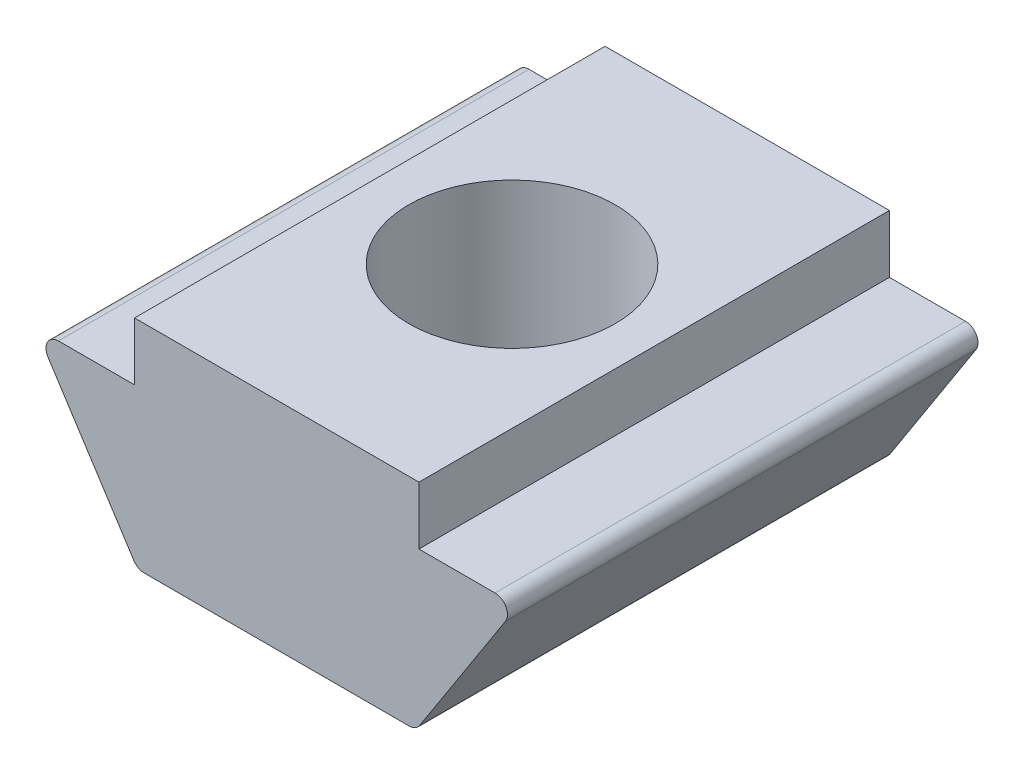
from build123d import *

# Parameters (mm, degrees)
BOSS_EXTRUDE1_DEPTH       = 9.58
FILLET1_R                 = 0.254
M5X0_8_TAPPED_HOLE1_D     = 4.2
M5X0_8_TAPPED_HOLE1_DEPTH = 13.97
M5X0_8_TAPPED_HOLE1_TIP   = 1.2618073


with BuildPart() as part:
    # Sketch1 → Boss-Extrude1 (new body)
    with BuildSketch(Plane.XY):
        Polygon((-2.895, 0), (2.895, 0), (2.895, -1.18), (4.91, -1.18), (2.835, -4.4), (-2.835, -4.4), (-4.91, -1.18), (-2.895, -1.18), align=None)
    extrude(amount=BOSS_EXTRUDE1_DEPTH)

    # Fillet1
    fillet1_edges = [part.edges().sort_by_distance(p)[0] for p in [
        (4.91, -1.18, 4.79),
        (2.835, -4.4, 4.79),
        (-2.835, -4.4, 4.79),
        (-4.91, -1.18, 4.79),
    ]]
    fillet(fillet1_edges, radius=FILLET1_R)

    # M5x0.8 Tapped Hole1
    with Locations(Plane(origin=(0, 0, 0), x_dir=(1, 0, 0), z_dir=(0, 1, 0))):
        with Locations((0, -4.79)):
            Hole(M5X0_8_TAPPED_HOLE1_D / 2, depth=M5X0_8_TAPPED_HOLE1_DEPTH)
            with Locations((0, 0, -(M5X0_8_TAPPED_HOLE1_DEPTH + M5X0_8_TAPPED_HOLE1_TIP / 2))):  # 118° drill point
                Cone(0, M5X0_8_TAPPED_HOLE1_D / 2, M5X0_8_TAPPED_HOLE1_TIP, mode=Mode.SUBTRACT)


solid = part.part
